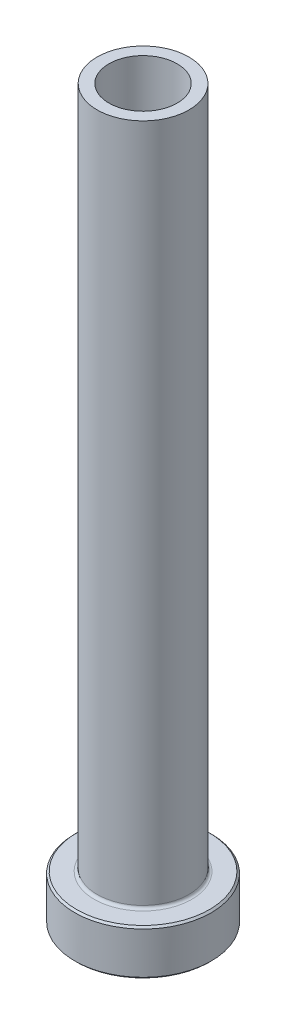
ISO-10303-21;
HEADER;
FILE_DESCRIPTION(('STEP AP214'),'2;1');
FILE_NAME('part.step','',(''),(''),'','','');
FILE_SCHEMA(('AUTOMOTIVE_DESIGN { 1 0 10303 214 1 1 1 1 }'));
ENDSEC;
DATA;
#1=APPLICATION_CONTEXT('core data for automotive mechanical design processes');
#2=APPLICATION_PROTOCOL_DEFINITION('international standard','automotive_design',2000,#1);
#3=PRODUCT_CONTEXT('',#1,'mechanical');
#4=PRODUCT('Part','Part','',(#3));
#5=PRODUCT_RELATED_PRODUCT_CATEGORY('part','',(#4));
#6=PRODUCT_DEFINITION_FORMATION('','',#4);
#7=PRODUCT_DEFINITION_CONTEXT('part definition',#1,'design');
#8=PRODUCT_DEFINITION('design','',#6,#7);
#9=PRODUCT_DEFINITION_SHAPE('','',#8);
#10=(LENGTH_UNIT() NAMED_UNIT(*) SI_UNIT(.MILLI.,.METRE.));
#11=(NAMED_UNIT(*) PLANE_ANGLE_UNIT() SI_UNIT($,.RADIAN.));
#12=(NAMED_UNIT(*) SI_UNIT($,.STERADIAN.) SOLID_ANGLE_UNIT());
#13=UNCERTAINTY_MEASURE_WITH_UNIT(LENGTH_MEASURE(1.E-05),#10,'distance_accuracy_value','');
#14=(GEOMETRIC_REPRESENTATION_CONTEXT(3) GLOBAL_UNCERTAINTY_ASSIGNED_CONTEXT((#13)) GLOBAL_UNIT_ASSIGNED_CONTEXT((#10,
#11,#12)) REPRESENTATION_CONTEXT('',''));
#15=CARTESIAN_POINT('',(0.,0.,0.));
#16=DIRECTION('',(0.,0.,1.));
#17=DIRECTION('',(1.,0.,0.));
#18=AXIS2_PLACEMENT_3D('',#15,#16,#17);
#19=CARTESIAN_POINT('',(0.,0.,0.));
#20=DIRECTION('',(0.,-1.,0.));
#21=DIRECTION('',(0.,0.,-1.));
#22=AXIS2_PLACEMENT_3D('',#19,#20,#21);
#23=PLANE('',#22);
#24=CARTESIAN_POINT('',(0.,0.,0.));
#25=DIRECTION('',(0.,-1.,0.));
#26=DIRECTION('',(0.,0.,-1.));
#27=AXIS2_PLACEMENT_3D('',#24,#25,#26);
#28=CIRCLE('',#27,9.27099999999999);
#29=CARTESIAN_POINT('',(0.,0.,-9.27099999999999));
#30=VERTEX_POINT('',#29);
#31=EDGE_CURVE('E44',#30,#30,#28,.T.);
#32=ORIENTED_EDGE('',*,*,#31,.T.);
#33=EDGE_LOOP('',(#32));
#34=FACE_BOUND('',#33,.T.);
#35=CARTESIAN_POINT('',(0.,0.,0.));
#36=DIRECTION('',(0.,-1.,0.));
#37=DIRECTION('',(0.,0.,-1.));
#38=AXIS2_PLACEMENT_3D('',#35,#36,#37);
#39=CIRCLE('',#38,5.34987500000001);
#40=CARTESIAN_POINT('',(0.,0.,-5.34987500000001));
#41=VERTEX_POINT('',#40);
#42=EDGE_CURVE('E58',#41,#41,#39,.T.);
#43=ORIENTED_EDGE('',*,*,#42,.F.);
#44=EDGE_LOOP('',(#43));
#45=FACE_BOUND('',#44,.T.);
#46=ADVANCED_FACE('F29',(#34,#45),#23,.T.);
#47=CARTESIAN_POINT('',(0.,0.,0.));
#48=DIRECTION('',(0.,-1.,0.));
#49=DIRECTION('',(0.,0.,-1.));
#50=AXIS2_PLACEMENT_3D('',#47,#48,#49);
#51=CYLINDRICAL_SURFACE('',#50,9.525);
#52=CARTESIAN_POINT('',(0.,0.254000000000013,0.));
#53=DIRECTION('',(0.,-1.,0.));
#54=DIRECTION('',(0.,0.,-1.));
#55=AXIS2_PLACEMENT_3D('',#52,#53,#54);
#56=CIRCLE('',#55,9.525);
#57=CARTESIAN_POINT('',(0.,0.254000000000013,-9.525));
#58=VERTEX_POINT('',#57);
#59=EDGE_CURVE('E36',#58,#58,#56,.F.);
#60=ORIENTED_EDGE('',*,*,#59,.T.);
#61=EDGE_LOOP('',(#60));
#62=FACE_BOUND('',#61,.T.);
#63=CARTESIAN_POINT('',(0.,6.09600000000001,0.));
#64=DIRECTION('',(0.,1.,0.));
#65=DIRECTION('',(0.,0.,1.));
#66=AXIS2_PLACEMENT_3D('',#63,#64,#65);
#67=CIRCLE('',#66,9.525);
#68=CARTESIAN_POINT('',(0.,6.09600000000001,9.525));
#69=VERTEX_POINT('',#68);
#70=EDGE_CURVE('E40',#69,#69,#67,.F.);
#71=ORIENTED_EDGE('',*,*,#70,.T.);
#72=EDGE_LOOP('',(#71));
#73=FACE_BOUND('',#72,.T.);
#74=ADVANCED_FACE('F103',(#62,#73),#51,.T.);
#75=CARTESIAN_POINT('',(9.525,6.35,0.));
#76=DIRECTION('',(0.,1.,0.));
#77=DIRECTION('',(0.,0.,1.));
#78=AXIS2_PLACEMENT_3D('',#75,#76,#77);
#79=PLANE('',#78);
#80=CARTESIAN_POINT('',(0.,6.35,0.));
#81=DIRECTION('',(0.,1.,0.));
#82=DIRECTION('',(0.,0.,1.));
#83=AXIS2_PLACEMENT_3D('',#80,#81,#82);
#84=CIRCLE('',#83,9.27100000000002);
#85=CARTESIAN_POINT('',(0.,6.35,9.27100000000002));
#86=VERTEX_POINT('',#85);
#87=EDGE_CURVE('E10',#86,#86,#84,.T.);
#88=ORIENTED_EDGE('',*,*,#87,.T.);
#89=EDGE_LOOP('',(#88));
#90=FACE_BOUND('',#89,.T.);
#91=CARTESIAN_POINT('',(0.,6.35,0.));
#92=DIRECTION('',(0.,-1.,0.));
#93=DIRECTION('',(0.,0.,-1.));
#94=AXIS2_PLACEMENT_3D('',#91,#92,#93);
#95=CIRCLE('',#94,6.804025);
#96=CARTESIAN_POINT('',(0.,6.35,-6.804025));
#97=VERTEX_POINT('',#96);
#98=EDGE_CURVE('E49',#97,#97,#95,.T.);
#99=ORIENTED_EDGE('',*,*,#98,.T.);
#100=EDGE_LOOP('',(#99));
#101=FACE_BOUND('',#100,.T.);
#102=ADVANCED_FACE('F109',(#90,#101),#79,.T.);
#103=CARTESIAN_POINT('',(0.,6.746875,0.));
#104=DIRECTION('',(0.,-1.,0.));
#105=DIRECTION('',(0.,0.,-1.));
#106=AXIS2_PLACEMENT_3D('',#103,#104,#105);
#107=TOROIDAL_SURFACE('',#106,6.804025,0.396874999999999);
#108=CARTESIAN_POINT('',(0.,6.746875,0.));
#109=DIRECTION('',(0.,-1.,0.));
#110=DIRECTION('',(0.,0.,-1.));
#111=AXIS2_PLACEMENT_3D('',#108,#109,#110);
#112=CIRCLE('',#111,6.40715);
#113=CARTESIAN_POINT('',(0.,6.746875,-6.40715));
#114=VERTEX_POINT('',#113);
#115=EDGE_CURVE('E52',#114,#114,#112,.T.);
#116=ORIENTED_EDGE('',*,*,#115,.T.);
#117=EDGE_LOOP('',(#116));
#118=FACE_BOUND('',#117,.T.);
#119=ORIENTED_EDGE('',*,*,#98,.F.);
#120=EDGE_LOOP('',(#119));
#121=FACE_BOUND('',#120,.T.);
#122=ADVANCED_FACE('F139',(#118,#121),#107,.F.);
#123=CARTESIAN_POINT('',(0.,0.,0.));
#124=DIRECTION('',(0.,-1.,0.));
#125=DIRECTION('',(0.,0.,-1.));
#126=AXIS2_PLACEMENT_3D('',#123,#124,#125);
#127=CYLINDRICAL_SURFACE('',#126,6.40715);
#128=CARTESIAN_POINT('',(0.,101.6,0.));
#129=DIRECTION('',(0.,-1.,0.));
#130=DIRECTION('',(0.,0.,-1.));
#131=AXIS2_PLACEMENT_3D('',#128,#129,#130);
#132=CIRCLE('',#131,6.40715);
#133=CARTESIAN_POINT('',(0.,101.6,-6.40715));
#134=VERTEX_POINT('',#133);
#135=EDGE_CURVE('E55',#134,#134,#132,.T.);
#136=ORIENTED_EDGE('',*,*,#135,.T.);
#137=EDGE_LOOP('',(#136));
#138=FACE_BOUND('',#137,.T.);
#139=ORIENTED_EDGE('',*,*,#115,.F.);
#140=EDGE_LOOP('',(#139));
#141=FACE_BOUND('',#140,.T.);
#142=ADVANCED_FACE('F182',(#138,#141),#127,.T.);
#143=CARTESIAN_POINT('',(6.40715,101.6,0.));
#144=DIRECTION('',(0.,1.,0.));
#145=DIRECTION('',(0.,0.,1.));
#146=AXIS2_PLACEMENT_3D('',#143,#144,#145);
#147=PLANE('',#146);
#148=CARTESIAN_POINT('',(0.,101.6,0.));
#149=DIRECTION('',(0.,-1.,0.));
#150=DIRECTION('',(0.,0.,-1.));
#151=AXIS2_PLACEMENT_3D('',#148,#149,#150);
#152=CIRCLE('',#151,4.7625);
#153=CARTESIAN_POINT('',(0.,101.6,-4.7625));
#154=VERTEX_POINT('',#153);
#155=EDGE_CURVE('E70',#154,#154,#152,.T.);
#156=ORIENTED_EDGE('',*,*,#155,.T.);
#157=EDGE_LOOP('',(#156));
#158=FACE_BOUND('',#157,.T.);
#159=ORIENTED_EDGE('',*,*,#135,.F.);
#160=EDGE_LOOP('',(#159));
#161=FACE_BOUND('',#160,.T.);
#162=ADVANCED_FACE('F74',(#158,#161),#147,.T.);
#163=CARTESIAN_POINT('',(0.,0.,0.));
#164=DIRECTION('',(0.,-1.,0.));
#165=DIRECTION('',(0.,0.,-1.));
#166=AXIS2_PLACEMENT_3D('',#163,#164,#165);
#167=CONICAL_SURFACE('',#166,5.34987500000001,0.785398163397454);
#168=CARTESIAN_POINT('',(0.,0.396875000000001,0.));
#169=DIRECTION('',(0.,-1.,0.));
#170=DIRECTION('',(0.,0.,-1.));
#171=AXIS2_PLACEMENT_3D('',#168,#169,#170);
#172=CIRCLE('',#171,4.953);
#173=CARTESIAN_POINT('',(0.,0.396875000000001,-4.953));
#174=VERTEX_POINT('',#173);
#175=EDGE_CURVE('E61',#174,#174,#172,.T.);
#176=ORIENTED_EDGE('',*,*,#175,.F.);
#177=EDGE_LOOP('',(#176));
#178=FACE_BOUND('',#177,.T.);
#179=ORIENTED_EDGE('',*,*,#42,.T.);
#180=EDGE_LOOP('',(#179));
#181=FACE_BOUND('',#180,.T.);
#182=ADVANCED_FACE('F93',(#178,#181),#167,.F.);
#183=CARTESIAN_POINT('',(0.,0.,0.));
#184=DIRECTION('',(0.,-1.,0.));
#185=DIRECTION('',(0.,0.,-1.));
#186=AXIS2_PLACEMENT_3D('',#183,#184,#185);
#187=CYLINDRICAL_SURFACE('',#186,4.953);
#188=CARTESIAN_POINT('',(0.,27.1145,0.));
#189=DIRECTION('',(0.,-1.,0.));
#190=DIRECTION('',(0.,0.,-1.));
#191=AXIS2_PLACEMENT_3D('',#188,#189,#190);
#192=CIRCLE('',#191,4.953);
#193=CARTESIAN_POINT('',(0.,27.1145,-4.953));
#194=VERTEX_POINT('',#193);
#195=EDGE_CURVE('E64',#194,#194,#192,.T.);
#196=ORIENTED_EDGE('',*,*,#195,.F.);
#197=EDGE_LOOP('',(#196));
#198=FACE_BOUND('',#197,.T.);
#199=ORIENTED_EDGE('',*,*,#175,.T.);
#200=EDGE_LOOP('',(#199));
#201=FACE_BOUND('',#200,.T.);
#202=ADVANCED_FACE('F87',(#198,#201),#187,.F.);
#203=CARTESIAN_POINT('',(0.,27.1145,0.));
#204=DIRECTION('',(0.,-1.,0.));
#205=DIRECTION('',(0.,0.,-1.));
#206=AXIS2_PLACEMENT_3D('',#203,#204,#205);
#207=CONICAL_SURFACE('',#206,4.953,0.0133325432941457);
#208=CARTESIAN_POINT('',(0.,41.402,0.));
#209=DIRECTION('',(0.,-1.,0.));
#210=DIRECTION('',(0.,0.,-1.));
#211=AXIS2_PLACEMENT_3D('',#208,#209,#210);
#212=CIRCLE('',#211,4.7625);
#213=CARTESIAN_POINT('',(0.,41.402,-4.7625));
#214=VERTEX_POINT('',#213);
#215=EDGE_CURVE('E67',#214,#214,#212,.T.);
#216=ORIENTED_EDGE('',*,*,#215,.F.);
#217=EDGE_LOOP('',(#216));
#218=FACE_BOUND('',#217,.T.);
#219=ORIENTED_EDGE('',*,*,#195,.T.);
#220=EDGE_LOOP('',(#219));
#221=FACE_BOUND('',#220,.T.);
#222=ADVANCED_FACE('F81',(#218,#221),#207,.F.);
#223=CARTESIAN_POINT('',(0.,0.,0.));
#224=DIRECTION('',(0.,-1.,0.));
#225=DIRECTION('',(0.,0.,-1.));
#226=AXIS2_PLACEMENT_3D('',#223,#224,#225);
#227=CYLINDRICAL_SURFACE('',#226,4.7625);
#228=ORIENTED_EDGE('',*,*,#155,.F.);
#229=EDGE_LOOP('',(#228));
#230=FACE_BOUND('',#229,.T.);
#231=ORIENTED_EDGE('',*,*,#215,.T.);
#232=EDGE_LOOP('',(#231));
#233=FACE_BOUND('',#232,.T.);
#234=ADVANCED_FACE('F77',(#230,#233),#227,.F.);
#235=CARTESIAN_POINT('',(0.,0.,0.));
#236=DIRECTION('',(0.,1.,0.));
#237=DIRECTION('',(0.,0.,1.));
#238=AXIS2_PLACEMENT_3D('',#235,#236,#237);
#239=CONICAL_SURFACE('',#238,9.27099999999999,0.785398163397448);
#240=ORIENTED_EDGE('',*,*,#59,.F.);
#241=EDGE_LOOP('',(#240));
#242=FACE_BOUND('',#241,.T.);
#243=ORIENTED_EDGE('',*,*,#31,.F.);
#244=EDGE_LOOP('',(#243));
#245=FACE_BOUND('',#244,.T.);
#246=ADVANCED_FACE('F80',(#242,#245),#239,.T.);
#247=CARTESIAN_POINT('',(0.,6.09600000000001,0.));
#248=DIRECTION('',(0.,-1.,0.));
#249=DIRECTION('',(0.,0.,-1.));
#250=AXIS2_PLACEMENT_3D('',#247,#248,#249);
#251=CONICAL_SURFACE('',#250,9.525,0.785398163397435);
#252=ORIENTED_EDGE('',*,*,#87,.F.);
#253=EDGE_LOOP('',(#252));
#254=FACE_BOUND('',#253,.T.);
#255=ORIENTED_EDGE('',*,*,#70,.F.);
#256=EDGE_LOOP('',(#255));
#257=FACE_BOUND('',#256,.T.);
#258=ADVANCED_FACE('F31',(#254,#257),#251,.T.);
#259=CLOSED_SHELL('',(#46,#74,#102,#122,#142,#162,#182,#202,#222,#234,#246,#258));
#260=MANIFOLD_SOLID_BREP('B2',#259);
#261=ADVANCED_BREP_SHAPE_REPRESENTATION('',(#18,#260),#14);
#262=SHAPE_DEFINITION_REPRESENTATION(#9,#261);
ENDSEC;
END-ISO-10303-21;
